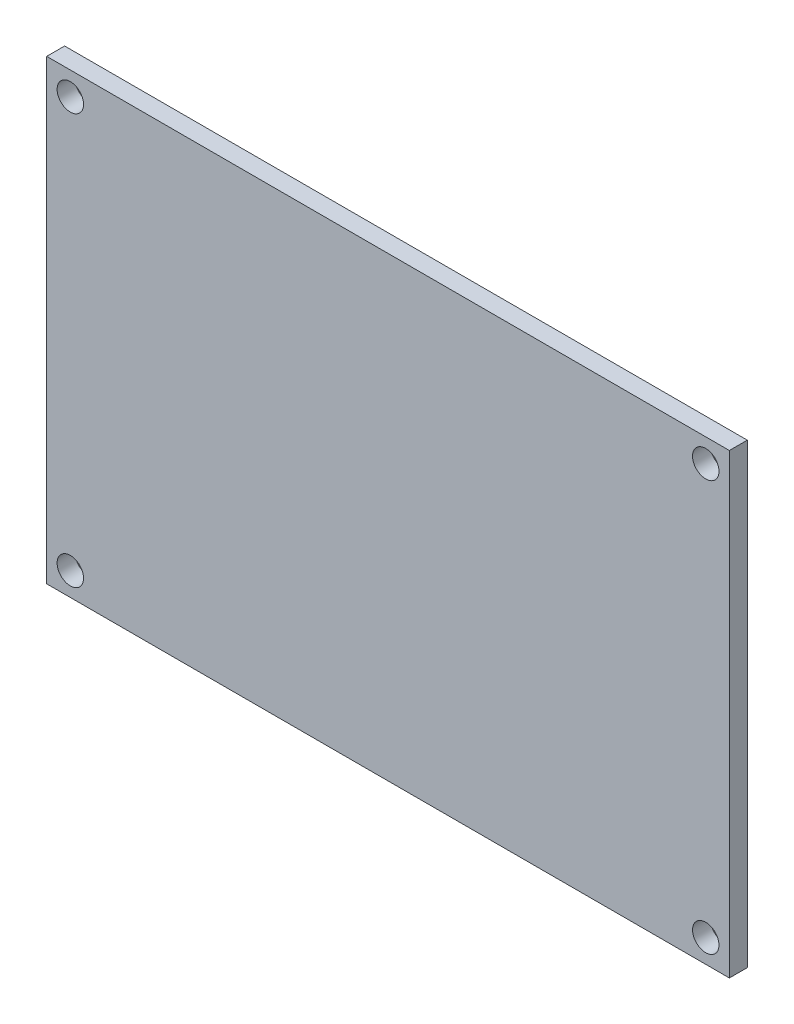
from build123d import *

# Parameters (mm, degrees)
SKETCH1_W           = 60.0075
SKETCH1_H           = 40.1574
SKETCH1_R           = 1.16205
BOSS_EXTRUDE1_DEPTH = 1.5748


with BuildPart() as part:
    # Sketch1 → Boss-Extrude1 (new body)
    with BuildSketch(Plane.XY):
        Rectangle(SKETCH1_W, SKETCH1_H)
        with Locations((27.9273, 18.034)):
            Circle(SKETCH1_R, mode=Mode.SUBTRACT)
        with Locations((27.9273, -18.034)):
            Circle(SKETCH1_R, mode=Mode.SUBTRACT)
        with Locations((-27.9273, -18.034)):
            Circle(SKETCH1_R, mode=Mode.SUBTRACT)
        with Locations((-27.9273, 18.034)):
            Circle(SKETCH1_R, mode=Mode.SUBTRACT)
    extrude(amount=BOSS_EXTRUDE1_DEPTH)


solid = part.part
